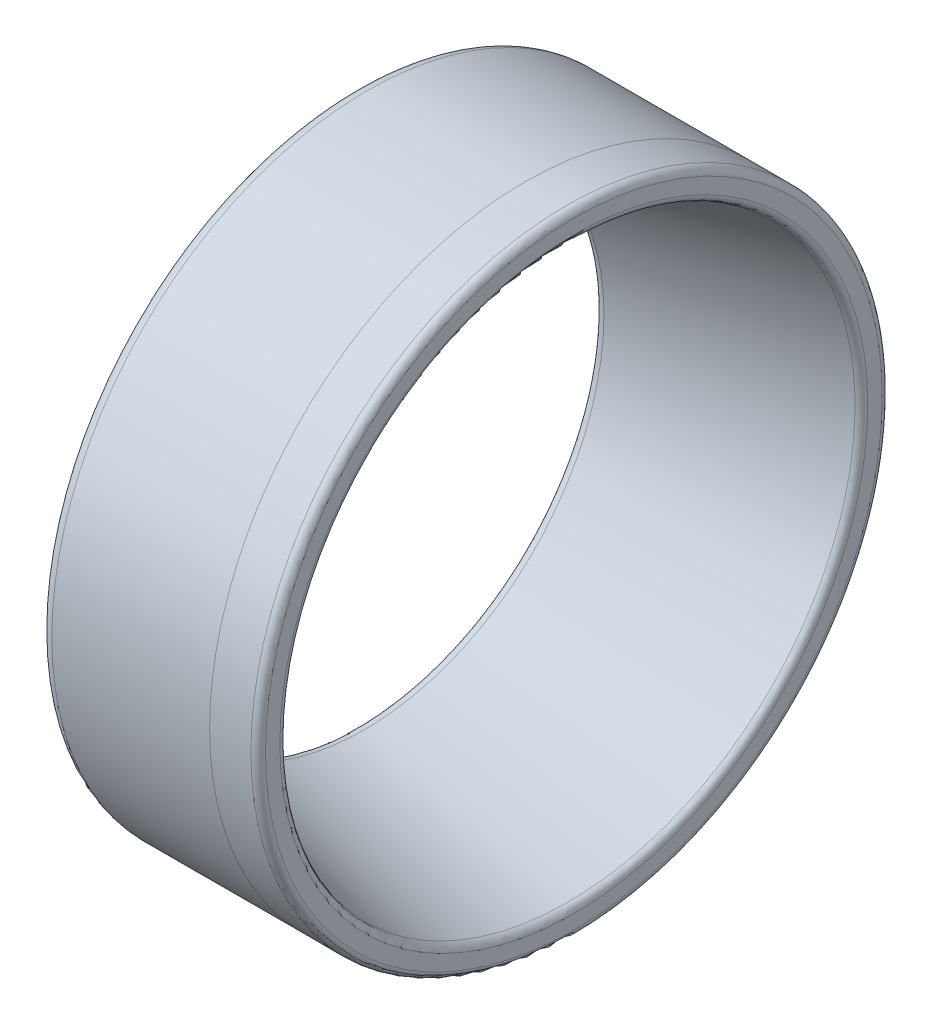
from build123d import *


with BuildPart() as part:
    # Esquisse2 → Base-R_volution (revolve)
    with BuildSketch(Plane.XY, mode=Mode.PRIVATE) as base_r_volution_sk:
        with BuildLine():
            Line((-13, 26), (3.4, 26))
            ThreePointArc((3.4, 26), (3.824264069, 25.824264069), (4, 25.4))
            Line((4, 25.4), (4, 24.212454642))
            ThreePointArc((4, 24.212454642), (3.869564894, 23.83894586), (3.534970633, 23.627832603))
            Line((3.534970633, 23.627832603), (-13.265029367, 19.749246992))
            ThreePointArc((-13.265029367, 19.749246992), (-13.773508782, 19.864304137), (-14, 20.333869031))
            Line((-14, 20.333869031), (-14, 25))
            ThreePointArc((-14, 25), (-13.707106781, 25.707106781), (-13, 26))
        make_face()
    revolve(base_r_volution_sk.sketch.rotate(Axis((-17.990056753, 0, 0), (1, 0, 0)), 90), axis=Axis((-17.990056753, 0, 0), (1, 0, 0)))


solid = part.part
